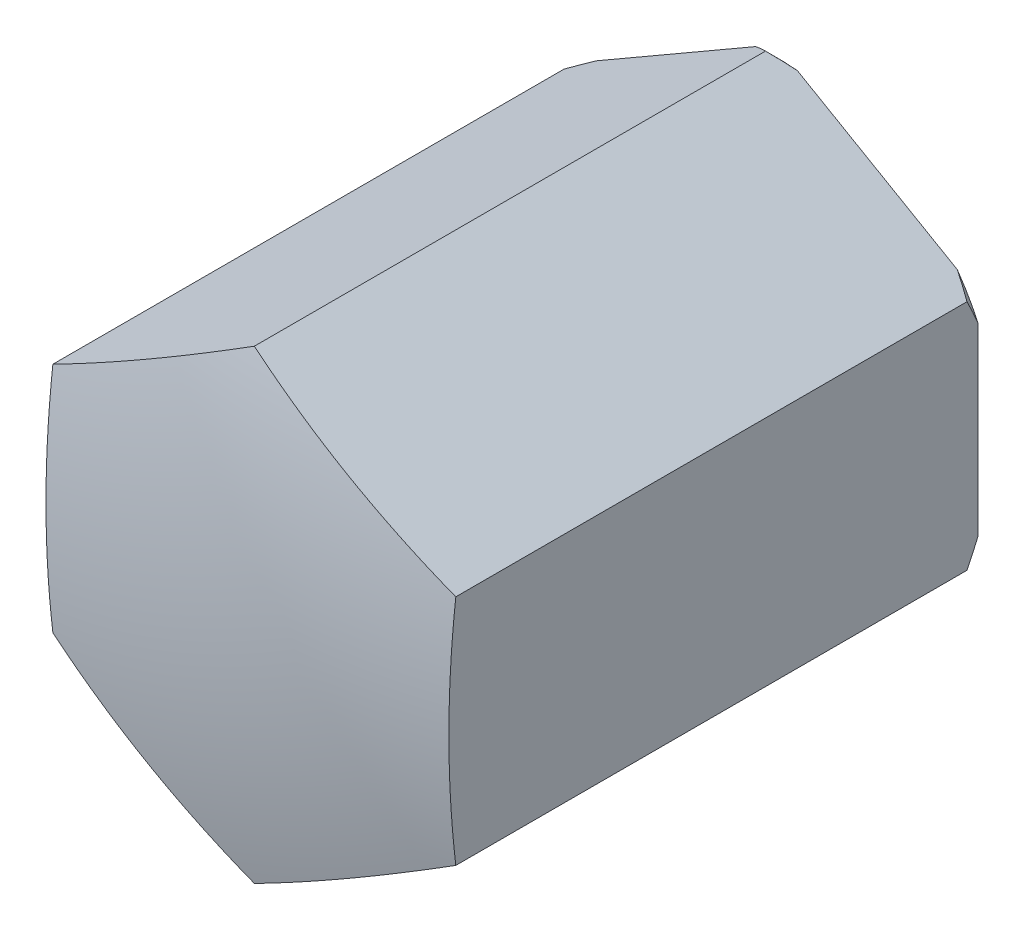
ISO-10303-21;
HEADER;
FILE_DESCRIPTION(('STEP AP214'),'2;1');
FILE_NAME('part.step','',(''),(''),'','','');
FILE_SCHEMA(('AUTOMOTIVE_DESIGN { 1 0 10303 214 1 1 1 1 }'));
ENDSEC;
DATA;
#1=APPLICATION_CONTEXT('core data for automotive mechanical design processes');
#2=APPLICATION_PROTOCOL_DEFINITION('international standard','automotive_design',2000,#1);
#3=PRODUCT_CONTEXT('',#1,'mechanical');
#4=PRODUCT('Part','Part','',(#3));
#5=PRODUCT_RELATED_PRODUCT_CATEGORY('part','',(#4));
#6=PRODUCT_DEFINITION_FORMATION('','',#4);
#7=PRODUCT_DEFINITION_CONTEXT('part definition',#1,'design');
#8=PRODUCT_DEFINITION('design','',#6,#7);
#9=PRODUCT_DEFINITION_SHAPE('','',#8);
#10=(LENGTH_UNIT() NAMED_UNIT(*) SI_UNIT(.MILLI.,.METRE.));
#11=(NAMED_UNIT(*) PLANE_ANGLE_UNIT() SI_UNIT($,.RADIAN.));
#12=(NAMED_UNIT(*) SI_UNIT($,.STERADIAN.) SOLID_ANGLE_UNIT());
#13=UNCERTAINTY_MEASURE_WITH_UNIT(LENGTH_MEASURE(1.E-05),#10,'distance_accuracy_value','');
#14=(GEOMETRIC_REPRESENTATION_CONTEXT(3) GLOBAL_UNCERTAINTY_ASSIGNED_CONTEXT((#13)) GLOBAL_UNIT_ASSIGNED_CONTEXT((#10,
#11,#12)) REPRESENTATION_CONTEXT('',''));
#15=CARTESIAN_POINT('',(0.,0.,0.));
#16=DIRECTION('',(0.,0.,1.));
#17=DIRECTION('',(1.,0.,0.));
#18=AXIS2_PLACEMENT_3D('',#15,#16,#17);
#19=CARTESIAN_POINT('',(0.,12.701705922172,31.));
#20=DIRECTION('',(0.500000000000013,-0.866025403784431,0.));
#21=DIRECTION('',(0.866025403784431,0.500000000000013,0.));
#22=AXIS2_PLACEMENT_3D('',#19,#20,#21);
#23=PLANE('',#22);
#24=CARTESIAN_POINT('',(-5.5000000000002,9.52627944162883,-25.));
#25=DIRECTION('',(0.500000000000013,-0.866025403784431,0.));
#26=DIRECTION('',(0.866025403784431,0.500000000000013,0.));
#27=AXIS2_PLACEMENT_3D('',#24,#25,#26);
#28=CIRCLE('',#27,53.8887743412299);
#29=CARTESIAN_POINT('',(0.,12.701705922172,28.5132382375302));
#30=VERTEX_POINT('',#29);
#31=CARTESIAN_POINT('',(-11.,6.3508529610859,28.5132382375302));
#32=VERTEX_POINT('',#31);
#33=EDGE_CURVE('E105',#30,#32,#28,.T.);
#34=ORIENTED_EDGE('',*,*,#33,.F.);
#35=DIRECTION('',(0.,0.,-1.));
#36=VECTOR('',#35,1.);
#37=CARTESIAN_POINT('',(0.,12.701705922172,31.));
#38=LINE('',#37,#36);
#39=CARTESIAN_POINT('',(0.,12.701705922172,0.601705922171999));
#40=VERTEX_POINT('',#39);
#41=EDGE_CURVE('E111',#30,#40,#38,.T.);
#42=ORIENTED_EDGE('',*,*,#41,.T.);
#43=CARTESIAN_POINT('',(0.000200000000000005,12.7018213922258,0.601821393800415));
#44=CARTESIAN_POINT('',(-0.0929349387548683,12.6480499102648,0.548049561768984));
#45=CARTESIAN_POINT('',(-0.186425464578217,12.594073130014,0.495094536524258));
#46=CARTESIAN_POINT('',(-0.374109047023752,12.4857139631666,0.390955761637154));
#47=CARTESIAN_POINT('',(-0.468301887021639,12.431331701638,0.339771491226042));
#48=CARTESIAN_POINT('',(-0.657438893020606,12.3221334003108,0.23927866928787));
#49=CARTESIAN_POINT('',(-0.752383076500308,12.2673173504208,0.189970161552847));
#50=CARTESIAN_POINT('',(-0.943063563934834,12.1572279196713,0.0933496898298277));
#51=CARTESIAN_POINT('',(-1.03880009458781,12.1019544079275,0.0460383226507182));
#52=CARTESIAN_POINT('',(-1.13492611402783,12.0464560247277,-0.00019999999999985));
#53=B_SPLINE_CURVE_WITH_KNOTS('',3,(#43,#44,#45,#46,#47,#48,#49,#50,#51,#52),.UNSPECIFIED.,.F.,
.F.,(4,2,2,2,4),(0.,0.360709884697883,0.721312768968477,1.08192406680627,1.44264237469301),.UNSPECIFIED.);
#54=CARTESIAN_POINT('',(-1.13451033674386,12.0466960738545,0.));
#55=VERTEX_POINT('',#54);
#56=EDGE_CURVE('E212',#40,#55,#53,.T.);
#57=ORIENTED_EDGE('',*,*,#56,.T.);
#58=DIRECTION('',(-0.866025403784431,-0.500000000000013,0.));
#59=VECTOR('',#58,1.);
#60=CARTESIAN_POINT('',(3.57499999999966,14.7657331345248,0.));
#61=LINE('',#60,#59);
#62=CARTESIAN_POINT('',(-9.86548966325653,7.00586280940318,0.));
#63=VERTEX_POINT('',#62);
#64=EDGE_CURVE('E23',#55,#63,#61,.T.);
#65=ORIENTED_EDGE('',*,*,#64,.T.);
#66=CARTESIAN_POINT('',(-9.86507388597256,7.00610285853,-0.000199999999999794));
#67=CARTESIAN_POINT('',(-9.96119990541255,6.95060447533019,0.046038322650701));
#68=CARTESIAN_POINT('',(-10.0569364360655,6.89533096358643,0.0933496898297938));
#69=CARTESIAN_POINT('',(-10.2476169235,6.78524153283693,0.189970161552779));
#70=CARTESIAN_POINT('',(-10.3425611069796,6.73042548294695,0.239278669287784));
#71=CARTESIAN_POINT('',(-10.5316981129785,6.62122718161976,0.339771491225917));
#72=CARTESIAN_POINT('',(-10.6258909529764,6.56684492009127,0.390955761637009));
#73=CARTESIAN_POINT('',(-10.8135745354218,6.4584857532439,0.495094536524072));
#74=CARTESIAN_POINT('',(-10.9070650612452,6.40450897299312,0.548049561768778));
#75=CARTESIAN_POINT('',(-11.0002,6.35073749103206,0.601821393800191));
#76=B_SPLINE_CURVE_WITH_KNOTS('',3,(#66,#67,#68,#69,#70,#71,#72,#73,#74,#75),.UNSPECIFIED.,.F.,
.F.,(4,2,2,2,4),(0.,0.360718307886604,0.721329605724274,1.08193248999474,1.4426423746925),.UNSPECIFIED.);
#77=CARTESIAN_POINT('',(-11.,6.3508529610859,0.601705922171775));
#78=VERTEX_POINT('',#77);
#79=EDGE_CURVE('E218',#63,#78,#76,.T.);
#80=ORIENTED_EDGE('',*,*,#79,.T.);
#81=DIRECTION('',(0.,0.,-1.));
#82=VECTOR('',#81,1.);
#83=CARTESIAN_POINT('',(-11.,6.3508529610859,31.));
#84=LINE('',#83,#82);
#85=EDGE_CURVE('E114',#32,#78,#84,.T.);
#86=ORIENTED_EDGE('',*,*,#85,.F.);
#87=EDGE_LOOP('',(#34,#42,#57,#65,#80,#86));
#88=FACE_BOUND('',#87,.T.);
#89=ADVANCED_FACE('F14',(#88),#23,.F.);
#90=CARTESIAN_POINT('',(-11.,6.3508529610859,31.));
#91=DIRECTION('',(1.,0.,0.));
#92=DIRECTION('',(0.,1.,0.));
#93=AXIS2_PLACEMENT_3D('',#90,#91,#92);
#94=PLANE('',#93);
#95=CARTESIAN_POINT('',(-11.,0.,-25.));
#96=DIRECTION('',(1.,0.,0.));
#97=DIRECTION('',(0.,0.,-1.));
#98=AXIS2_PLACEMENT_3D('',#95,#96,#97);
#99=CIRCLE('',#98,53.8887743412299);
#100=CARTESIAN_POINT('',(-11.,-6.3508529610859,28.5132382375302));
#101=VERTEX_POINT('',#100);
#102=EDGE_CURVE('E115',#32,#101,#99,.T.);
#103=ORIENTED_EDGE('',*,*,#102,.F.);
#104=ORIENTED_EDGE('',*,*,#85,.T.);
#105=CARTESIAN_POINT('',(-11.,16.0724477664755,7.37623108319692));
#106=CARTESIAN_POINT('',(-11.,15.8702057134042,7.2093371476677));
#107=CARTESIAN_POINT('',(-11.,15.6674737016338,7.04303709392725));
#108=CARTESIAN_POINT('',(-11.,15.2609313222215,6.71175492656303));
#109=CARTESIAN_POINT('',(-11.,15.0571209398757,6.54677283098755));
#110=CARTESIAN_POINT('',(-11.,14.4438351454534,6.05392702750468));
#111=CARTESIAN_POINT('',(-11.,14.0326017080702,5.72824373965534));
#112=CARTESIAN_POINT('',(-11.,13.1999564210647,5.08050106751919));
#113=CARTESIAN_POINT('',(-11.,12.7784823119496,4.75852150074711));
#114=CARTESIAN_POINT('',(-11.,11.9286566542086,4.12384110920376));
#115=CARTESIAN_POINT('',(-11.,11.5003057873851,3.81113937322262));
#116=CARTESIAN_POINT('',(-11.,10.5931500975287,3.16769731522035));
#117=CARTESIAN_POINT('',(-11.,10.1134868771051,2.83815635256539));
#118=CARTESIAN_POINT('',(-11.,9.38449294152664,2.35805816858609));
#119=CARTESIAN_POINT('',(-11.,9.13985858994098,2.20036220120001));
#120=CARTESIAN_POINT('',(-11.,8.64708986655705,1.89054685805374));
#121=CARTESIAN_POINT('',(-11.,8.39895566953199,1.73842720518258));
#122=CARTESIAN_POINT('',(-11.,7.89995903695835,1.441394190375));
#123=CARTESIAN_POINT('',(-11.,7.64911460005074,1.29645066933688));
#124=CARTESIAN_POINT('',(-11.,7.14316420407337,1.01414178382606));
#125=CARTESIAN_POINT('',(-11.,6.8880580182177,0.876776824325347));
#126=CARTESIAN_POINT('',(-11.,6.37340355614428,0.611087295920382));
#127=CARTESIAN_POINT('',(-11.,6.11385871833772,0.482756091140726));
#128=CARTESIAN_POINT('',(-11.,5.58983912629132,0.236644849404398));
#129=CARTESIAN_POINT('',(-11.,5.32536528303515,0.118862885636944));
#130=CARTESIAN_POINT('',(-11.,4.87055760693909,-0.0711489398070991));
#131=CARTESIAN_POINT('',(-11.,4.68153595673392,-0.146517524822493));
#132=CARTESIAN_POINT('',(-11.,4.30090682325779,-0.290396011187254));
#133=CARTESIAN_POINT('',(-11.,4.10929935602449,-0.35890595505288));
#134=CARTESIAN_POINT('',(-11.,3.53054922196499,-0.55302199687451));
#135=CARTESIAN_POINT('',(-11.,3.13947003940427,-0.667218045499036));
#136=CARTESIAN_POINT('',(-11.,2.3571577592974,-0.856520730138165));
#137=CARTESIAN_POINT('',(-11.,1.96613010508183,-0.932456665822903));
#138=CARTESIAN_POINT('',(-11.,1.3754168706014,-1.01606525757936));
#139=CARTESIAN_POINT('',(-11.,1.17780635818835,-1.03888598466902));
#140=CARTESIAN_POINT('',(-11.,0.781637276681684,-1.0740268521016));
#141=CARTESIAN_POINT('',(-11.,0.583078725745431,-1.0863471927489));
#142=CARTESIAN_POINT('',(-11.,0.196510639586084,-1.09984708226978));
#143=CARTESIAN_POINT('',(-11.,0.00852086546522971,-1.10160151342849));
#144=CARTESIAN_POINT('',(-11.,-0.367323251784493,-1.09547279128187));
#145=CARTESIAN_POINT('',(-11.,-0.555177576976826,-1.08758853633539));
#146=CARTESIAN_POINT('',(-11.,-0.930229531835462,-1.06232225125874));
#147=CARTESIAN_POINT('',(-11.,-1.11742721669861,-1.04494103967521));
#148=CARTESIAN_POINT('',(-11.,-1.49075054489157,-1.00099406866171));
#149=CARTESIAN_POINT('',(-11.,-1.67687603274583,-0.974427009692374));
#150=CARTESIAN_POINT('',(-11.,-2.24018324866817,-0.880381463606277));
#151=CARTESIAN_POINT('',(-11.,-2.61511811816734,-0.799063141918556));
#152=CARTESIAN_POINT('',(-11.,-3.35650285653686,-0.604878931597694));
#153=CARTESIAN_POINT('',(-11.,-3.72295280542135,-0.492013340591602));
#154=CARTESIAN_POINT('',(-11.,-4.4529629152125,-0.237887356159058));
#155=CARTESIAN_POINT('',(-11.,-4.81636046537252,-0.0961649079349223));
#156=CARTESIAN_POINT('',(-11.,-5.53386860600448,0.20927334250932));
#157=CARTESIAN_POINT('',(-11.,-5.88797506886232,0.372998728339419));
#158=CARTESIAN_POINT('',(-11.,-6.5885282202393,0.718563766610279));
#159=CARTESIAN_POINT('',(-11.,-6.93494780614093,0.900457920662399));
#160=CARTESIAN_POINT('',(-11.,-7.61987412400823,1.27837528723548));
#161=CARTESIAN_POINT('',(-11.,-7.95838202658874,1.47439639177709));
#162=CARTESIAN_POINT('',(-11.,-8.61194162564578,1.86785203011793));
#163=CARTESIAN_POINT('',(-11.,-8.92732558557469,2.06473756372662));
#164=CARTESIAN_POINT('',(-11.,-9.55267412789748,2.46695903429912));
#165=CARTESIAN_POINT('',(-11.,-9.86263830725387,2.67229559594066));
#166=CARTESIAN_POINT('',(-11.,-10.4753887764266,3.08826754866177));
#167=CARTESIAN_POINT('',(-11.,-10.7782124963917,3.29884800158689));
#168=CARTESIAN_POINT('',(-11.,-11.3796956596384,3.72570793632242));
#169=CARTESIAN_POINT('',(-11.,-11.6783562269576,3.94198583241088));
#170=CARTESIAN_POINT('',(-11.,-11.9752680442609,4.16059792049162));
#171=B_SPLINE_CURVE_WITH_KNOTS('',3,(#105,#106,#107,#108,#109,#110,#111,#112,#113,#114,#115,
#116,#117,#118,#119,#120,#121,#122,#123,#124,#125,#126,#127,#128,#129,#130,#131,#132,#133,#134,
#135,#136,#137,#138,#139,#140,#141,#142,#143,#144,#145,#146,#147,#148,#149,#150,#151,#152,#153,
#154,#155,#156,#157,#158,#159,#160,#161,#162,#163,#164,#165,#166,#167,#168,#169,#170),
.UNSPECIFIED.,.F.,.F.,(4,2,2,2,2,2,2,2,2,2,2,2,2,2,2,2,2,2,2,2,2,2,2,2,2,2,2,2,2,2,2,2,4),(0.,
0.7866358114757,1.57328237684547,3.14695168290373,4.73801099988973,6.32891353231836,
8.0743905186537,8.94750152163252,9.82056907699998,10.6895860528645,11.5586494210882,
12.4270675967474,13.2953268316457,13.9056838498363,14.5160370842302,15.7367149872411,
16.9296541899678,17.5261883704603,18.1227111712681,18.6864613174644,19.2502759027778,
19.8140419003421,20.3778876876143,21.5270730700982,22.6762476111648,23.845519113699,
25.0153015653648,26.1887049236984,27.3619335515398,28.4771587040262,29.5924664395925,
30.698929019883,31.8050868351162),.UNSPECIFIED.);
#172=CARTESIAN_POINT('',(-11.,5.04083326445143,0.));
#173=VERTEX_POINT('',#172);
#174=EDGE_CURVE('E211',#78,#173,#171,.T.);
#175=ORIENTED_EDGE('',*,*,#174,.T.);
#176=DIRECTION('',(0.,-1.,0.));
#177=VECTOR('',#176,1.);
#178=CARTESIAN_POINT('',(-11.,0.,0.));
#179=LINE('',#178,#177);
#180=CARTESIAN_POINT('',(-11.,-5.04083326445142,0.));
#181=VERTEX_POINT('',#180);
#182=EDGE_CURVE('E237',#173,#181,#179,.T.);
#183=ORIENTED_EDGE('',*,*,#182,.T.);
#184=CARTESIAN_POINT('',(-11.,-6.3508529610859,0.601705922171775));
#185=VERTEX_POINT('',#184);
#186=EDGE_CURVE('E204',#181,#185,#171,.T.);
#187=ORIENTED_EDGE('',*,*,#186,.T.);
#188=DIRECTION('',(0.,0.,-1.));
#189=VECTOR('',#188,1.);
#190=CARTESIAN_POINT('',(-11.,-6.3508529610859,31.));
#191=LINE('',#190,#189);
#192=EDGE_CURVE('E130',#101,#185,#191,.T.);
#193=ORIENTED_EDGE('',*,*,#192,.F.);
#194=EDGE_LOOP('',(#103,#104,#175,#183,#187,#193));
#195=FACE_BOUND('',#194,.T.);
#196=ADVANCED_FACE('F196',(#195),#94,.F.);
#197=CARTESIAN_POINT('',(-11.,-6.3508529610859,31.));
#198=DIRECTION('',(0.500000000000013,0.866025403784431,0.));
#199=DIRECTION('',(-0.866025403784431,0.500000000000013,0.));
#200=AXIS2_PLACEMENT_3D('',#197,#198,#199);
#201=PLANE('',#200);
#202=CARTESIAN_POINT('',(-5.5000000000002,-9.52627944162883,-25.));
#203=DIRECTION('',(0.500000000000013,0.866025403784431,0.));
#204=DIRECTION('',(-0.866025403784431,0.500000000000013,0.));
#205=AXIS2_PLACEMENT_3D('',#202,#203,#204);
#206=CIRCLE('',#205,53.8887743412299);
#207=CARTESIAN_POINT('',(0.,-12.701705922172,28.5132382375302));
#208=VERTEX_POINT('',#207);
#209=EDGE_CURVE('E284',#101,#208,#206,.T.);
#210=ORIENTED_EDGE('',*,*,#209,.F.);
#211=ORIENTED_EDGE('',*,*,#192,.T.);
#212=CARTESIAN_POINT('',(-11.0002,-6.35073749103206,0.601821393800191));
#213=CARTESIAN_POINT('',(-10.9070650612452,-6.40450897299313,0.548049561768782));
#214=CARTESIAN_POINT('',(-10.8135745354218,-6.4584857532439,0.495094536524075));
#215=CARTESIAN_POINT('',(-10.6258909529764,-6.56684492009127,0.390955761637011));
#216=CARTESIAN_POINT('',(-10.5316981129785,-6.62122718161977,0.339771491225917));
#217=CARTESIAN_POINT('',(-10.3425611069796,-6.73042548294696,0.239278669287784));
#218=CARTESIAN_POINT('',(-10.2476169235,-6.78524153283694,0.189970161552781));
#219=CARTESIAN_POINT('',(-10.0569364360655,-6.89533096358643,0.093349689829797));
#220=CARTESIAN_POINT('',(-9.96119990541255,-6.95060447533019,0.0460383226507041));
#221=CARTESIAN_POINT('',(-9.86507388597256,-7.00610285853,-0.0002000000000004));
#222=B_SPLINE_CURVE_WITH_KNOTS('',3,(#212,#213,#214,#215,#216,#217,#218,#219,#220,#221),
.UNSPECIFIED.,.F.,.F.,(4,2,2,2,4),(0.,0.360709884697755,0.721312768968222,1.08192406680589,
1.4426423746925),.UNSPECIFIED.);
#223=CARTESIAN_POINT('',(-9.86548966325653,-7.00586280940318,0.));
#224=VERTEX_POINT('',#223);
#225=EDGE_CURVE('E180',#185,#224,#222,.T.);
#226=ORIENTED_EDGE('',*,*,#225,.T.);
#227=DIRECTION('',(0.866025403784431,-0.500000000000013,0.));
#228=VECTOR('',#227,1.);
#229=CARTESIAN_POINT('',(3.57499999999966,-14.7657331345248,0.));
#230=LINE('',#229,#228);
#231=CARTESIAN_POINT('',(-1.13451033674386,-12.0466960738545,0.));
#232=VERTEX_POINT('',#231);
#233=EDGE_CURVE('E235',#224,#232,#230,.T.);
#234=ORIENTED_EDGE('',*,*,#233,.T.);
#235=CARTESIAN_POINT('',(-1.13492611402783,-12.0464560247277,-0.0002));
#236=CARTESIAN_POINT('',(-1.03880009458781,-12.1019544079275,0.0460383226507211));
#237=CARTESIAN_POINT('',(-0.943063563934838,-12.1572279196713,0.0933496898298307));
#238=CARTESIAN_POINT('',(-0.752383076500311,-12.2673173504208,0.189970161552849));
#239=CARTESIAN_POINT('',(-0.657438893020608,-12.3221334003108,0.23927866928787));
#240=CARTESIAN_POINT('',(-0.46830188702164,-12.431331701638,0.339771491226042));
#241=CARTESIAN_POINT('',(-0.374109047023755,-12.4857139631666,0.390955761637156));
#242=CARTESIAN_POINT('',(-0.186425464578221,-12.594073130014,0.495094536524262));
#243=CARTESIAN_POINT('',(-0.0929349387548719,-12.6480499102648,0.548049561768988));
#244=CARTESIAN_POINT('',(0.000199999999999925,-12.7018213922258,0.601821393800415));
#245=B_SPLINE_CURVE_WITH_KNOTS('',3,(#235,#236,#237,#238,#239,#240,#241,#242,#243,#244),
.UNSPECIFIED.,.F.,.F.,(4,2,2,2,4),(0.,0.360718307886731,0.721329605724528,1.08193248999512,
1.44264237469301),.UNSPECIFIED.);
#246=CARTESIAN_POINT('',(0.,-12.701705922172,0.601705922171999));
#247=VERTEX_POINT('',#246);
#248=EDGE_CURVE('E186',#232,#247,#245,.T.);
#249=ORIENTED_EDGE('',*,*,#248,.T.);
#250=DIRECTION('',(0.,0.,-1.));
#251=VECTOR('',#250,1.);
#252=CARTESIAN_POINT('',(0.,-12.701705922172,31.));
#253=LINE('',#252,#251);
#254=EDGE_CURVE('E128',#208,#247,#253,.T.);
#255=ORIENTED_EDGE('',*,*,#254,.F.);
#256=EDGE_LOOP('',(#210,#211,#226,#234,#249,#255));
#257=FACE_BOUND('',#256,.T.);
#258=ADVANCED_FACE('F192',(#257),#201,.F.);
#259=CARTESIAN_POINT('',(0.,-12.701705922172,31.));
#260=DIRECTION('',(-0.500000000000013,0.866025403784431,0.));
#261=DIRECTION('',(-0.866025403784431,-0.500000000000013,0.));
#262=AXIS2_PLACEMENT_3D('',#259,#260,#261);
#263=PLANE('',#262);
#264=CARTESIAN_POINT('',(5.5000000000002,-9.52627944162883,-25.));
#265=DIRECTION('',(-0.500000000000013,0.866025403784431,0.));
#266=DIRECTION('',(-0.866025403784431,-0.500000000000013,0.));
#267=AXIS2_PLACEMENT_3D('',#264,#265,#266);
#268=CIRCLE('',#267,53.8887743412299);
#269=CARTESIAN_POINT('',(11.,-6.3508529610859,28.5132382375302));
#270=VERTEX_POINT('',#269);
#271=EDGE_CURVE('E285',#208,#270,#268,.T.);
#272=ORIENTED_EDGE('',*,*,#271,.F.);
#273=ORIENTED_EDGE('',*,*,#254,.T.);
#274=CARTESIAN_POINT('',(-0.000200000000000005,-12.7018213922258,0.601821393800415));
#275=CARTESIAN_POINT('',(0.0929349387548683,-12.6480499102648,0.548049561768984));
#276=CARTESIAN_POINT('',(0.186425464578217,-12.594073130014,0.495094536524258));
#277=CARTESIAN_POINT('',(0.374109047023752,-12.4857139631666,0.390955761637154));
#278=CARTESIAN_POINT('',(0.468301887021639,-12.431331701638,0.339771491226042));
#279=CARTESIAN_POINT('',(0.657438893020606,-12.3221334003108,0.23927866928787));
#280=CARTESIAN_POINT('',(0.752383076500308,-12.2673173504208,0.189970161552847));
#281=CARTESIAN_POINT('',(0.943063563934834,-12.1572279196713,0.0933496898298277));
#282=CARTESIAN_POINT('',(1.03880009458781,-12.1019544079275,0.0460383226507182));
#283=CARTESIAN_POINT('',(1.13492611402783,-12.0464560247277,-0.00019999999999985));
#284=B_SPLINE_CURVE_WITH_KNOTS('',3,(#274,#275,#276,#277,#278,#279,#280,#281,#282,#283),
.UNSPECIFIED.,.F.,.F.,(4,2,2,2,4),(0.,0.360709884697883,0.721312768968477,1.08192406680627,
1.44264237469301),.UNSPECIFIED.);
#285=CARTESIAN_POINT('',(1.13451033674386,-12.0466960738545,0.));
#286=VERTEX_POINT('',#285);
#287=EDGE_CURVE('E167',#247,#286,#284,.T.);
#288=ORIENTED_EDGE('',*,*,#287,.T.);
#289=DIRECTION('',(0.866025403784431,0.500000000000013,0.));
#290=VECTOR('',#289,1.);
#291=CARTESIAN_POINT('',(14.575,-4.28682574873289,0.));
#292=LINE('',#291,#290);
#293=CARTESIAN_POINT('',(9.86548966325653,-7.00586280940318,0.));
#294=VERTEX_POINT('',#293);
#295=EDGE_CURVE('E233',#286,#294,#292,.T.);
#296=ORIENTED_EDGE('',*,*,#295,.T.);
#297=CARTESIAN_POINT('',(9.86507388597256,-7.00610285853,-0.000199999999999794));
#298=CARTESIAN_POINT('',(9.96119990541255,-6.95060447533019,0.046038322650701));
#299=CARTESIAN_POINT('',(10.0569364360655,-6.89533096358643,0.0933496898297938));
#300=CARTESIAN_POINT('',(10.2476169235,-6.78524153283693,0.189970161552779));
#301=CARTESIAN_POINT('',(10.3425611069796,-6.73042548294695,0.239278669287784));
#302=CARTESIAN_POINT('',(10.5316981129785,-6.62122718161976,0.339771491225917));
#303=CARTESIAN_POINT('',(10.6258909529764,-6.56684492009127,0.390955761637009));
#304=CARTESIAN_POINT('',(10.8135745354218,-6.4584857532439,0.495094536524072));
#305=CARTESIAN_POINT('',(10.9070650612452,-6.40450897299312,0.548049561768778));
#306=CARTESIAN_POINT('',(11.0002,-6.35073749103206,0.601821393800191));
#307=B_SPLINE_CURVE_WITH_KNOTS('',3,(#297,#298,#299,#300,#301,#302,#303,#304,#305,#306),
.UNSPECIFIED.,.F.,.F.,(4,2,2,2,4),(0.,0.360718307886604,0.721329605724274,1.08193248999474,
1.4426423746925),.UNSPECIFIED.);
#308=CARTESIAN_POINT('',(11.,-6.3508529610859,0.601705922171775));
#309=VERTEX_POINT('',#308);
#310=EDGE_CURVE('E173',#294,#309,#307,.T.);
#311=ORIENTED_EDGE('',*,*,#310,.T.);
#312=DIRECTION('',(0.,0.,-1.));
#313=VECTOR('',#312,1.);
#314=CARTESIAN_POINT('',(11.,-6.3508529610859,31.));
#315=LINE('',#314,#313);
#316=EDGE_CURVE('E123',#270,#309,#315,.T.);
#317=ORIENTED_EDGE('',*,*,#316,.F.);
#318=EDGE_LOOP('',(#272,#273,#288,#296,#311,#317));
#319=FACE_BOUND('',#318,.T.);
#320=ADVANCED_FACE('F155',(#319),#263,.F.);
#321=CARTESIAN_POINT('',(11.,-6.3508529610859,31.));
#322=DIRECTION('',(-1.,0.,0.));
#323=DIRECTION('',(0.,-1.,0.));
#324=AXIS2_PLACEMENT_3D('',#321,#322,#323);
#325=PLANE('',#324);
#326=CARTESIAN_POINT('',(11.,0.,-25.));
#327=DIRECTION('',(-1.,0.,0.));
#328=DIRECTION('',(0.,0.,1.));
#329=AXIS2_PLACEMENT_3D('',#326,#327,#328);
#330=CIRCLE('',#329,53.8887743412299);
#331=CARTESIAN_POINT('',(11.,6.3508529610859,28.5132382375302));
#332=VERTEX_POINT('',#331);
#333=EDGE_CURVE('E29',#270,#332,#330,.T.);
#334=ORIENTED_EDGE('',*,*,#333,.F.);
#335=ORIENTED_EDGE('',*,*,#316,.T.);
#336=CARTESIAN_POINT('',(11.,16.0724477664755,7.37623108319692));
#337=CARTESIAN_POINT('',(11.,15.8702057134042,7.2093371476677));
#338=CARTESIAN_POINT('',(11.,15.6674737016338,7.04303709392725));
#339=CARTESIAN_POINT('',(11.,15.2609313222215,6.71175492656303));
#340=CARTESIAN_POINT('',(11.,15.0571209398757,6.54677283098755));
#341=CARTESIAN_POINT('',(11.,14.4438351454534,6.05392702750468));
#342=CARTESIAN_POINT('',(11.,14.0326017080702,5.72824373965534));
#343=CARTESIAN_POINT('',(11.,13.1999564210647,5.08050106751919));
#344=CARTESIAN_POINT('',(11.,12.7784823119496,4.75852150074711));
#345=CARTESIAN_POINT('',(11.,11.9286566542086,4.12384110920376));
#346=CARTESIAN_POINT('',(11.,11.5003057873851,3.81113937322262));
#347=CARTESIAN_POINT('',(11.,10.5931500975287,3.16769731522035));
#348=CARTESIAN_POINT('',(11.,10.1134868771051,2.83815635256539));
#349=CARTESIAN_POINT('',(11.,9.38449294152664,2.35805816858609));
#350=CARTESIAN_POINT('',(11.,9.13985858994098,2.20036220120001));
#351=CARTESIAN_POINT('',(11.,8.64708986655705,1.89054685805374));
#352=CARTESIAN_POINT('',(11.,8.39895566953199,1.73842720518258));
#353=CARTESIAN_POINT('',(11.,7.89995903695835,1.441394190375));
#354=CARTESIAN_POINT('',(11.,7.64911460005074,1.29645066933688));
#355=CARTESIAN_POINT('',(11.,7.14316420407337,1.01414178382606));
#356=CARTESIAN_POINT('',(11.,6.8880580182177,0.876776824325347));
#357=CARTESIAN_POINT('',(11.,6.37340355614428,0.611087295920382));
#358=CARTESIAN_POINT('',(11.,6.11385871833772,0.482756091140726));
#359=CARTESIAN_POINT('',(11.,5.58983912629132,0.236644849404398));
#360=CARTESIAN_POINT('',(11.,5.32536528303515,0.118862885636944));
#361=CARTESIAN_POINT('',(11.,4.87055760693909,-0.0711489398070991));
#362=CARTESIAN_POINT('',(11.,4.68153595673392,-0.146517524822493));
#363=CARTESIAN_POINT('',(11.,4.30090682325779,-0.290396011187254));
#364=CARTESIAN_POINT('',(11.,4.10929935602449,-0.35890595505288));
#365=CARTESIAN_POINT('',(11.,3.53054922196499,-0.55302199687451));
#366=CARTESIAN_POINT('',(11.,3.13947003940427,-0.667218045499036));
#367=CARTESIAN_POINT('',(11.,2.3571577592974,-0.856520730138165));
#368=CARTESIAN_POINT('',(11.,1.96613010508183,-0.932456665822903));
#369=CARTESIAN_POINT('',(11.,1.3754168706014,-1.01606525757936));
#370=CARTESIAN_POINT('',(11.,1.17780635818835,-1.03888598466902));
#371=CARTESIAN_POINT('',(11.,0.781637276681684,-1.0740268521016));
#372=CARTESIAN_POINT('',(11.,0.583078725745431,-1.0863471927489));
#373=CARTESIAN_POINT('',(11.,0.196510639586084,-1.09984708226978));
#374=CARTESIAN_POINT('',(11.,0.00852086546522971,-1.10160151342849));
#375=CARTESIAN_POINT('',(11.,-0.367323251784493,-1.09547279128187));
#376=CARTESIAN_POINT('',(11.,-0.555177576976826,-1.08758853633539));
#377=CARTESIAN_POINT('',(11.,-0.930229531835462,-1.06232225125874));
#378=CARTESIAN_POINT('',(11.,-1.11742721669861,-1.04494103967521));
#379=CARTESIAN_POINT('',(11.,-1.49075054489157,-1.00099406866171));
#380=CARTESIAN_POINT('',(11.,-1.67687603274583,-0.974427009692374));
#381=CARTESIAN_POINT('',(11.,-2.24018324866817,-0.880381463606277));
#382=CARTESIAN_POINT('',(11.,-2.61511811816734,-0.799063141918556));
#383=CARTESIAN_POINT('',(11.,-3.35650285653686,-0.604878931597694));
#384=CARTESIAN_POINT('',(11.,-3.72295280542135,-0.492013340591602));
#385=CARTESIAN_POINT('',(11.,-4.4529629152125,-0.237887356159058));
#386=CARTESIAN_POINT('',(11.,-4.81636046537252,-0.0961649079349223));
#387=CARTESIAN_POINT('',(11.,-5.53386860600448,0.20927334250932));
#388=CARTESIAN_POINT('',(11.,-5.88797506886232,0.372998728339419));
#389=CARTESIAN_POINT('',(11.,-6.5885282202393,0.718563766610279));
#390=CARTESIAN_POINT('',(11.,-6.93494780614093,0.900457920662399));
#391=CARTESIAN_POINT('',(11.,-7.61987412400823,1.27837528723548));
#392=CARTESIAN_POINT('',(11.,-7.95838202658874,1.47439639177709));
#393=CARTESIAN_POINT('',(11.,-8.61194162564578,1.86785203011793));
#394=CARTESIAN_POINT('',(11.,-8.92732558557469,2.06473756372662));
#395=CARTESIAN_POINT('',(11.,-9.55267412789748,2.46695903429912));
#396=CARTESIAN_POINT('',(11.,-9.86263830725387,2.67229559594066));
#397=CARTESIAN_POINT('',(11.,-10.4753887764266,3.08826754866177));
#398=CARTESIAN_POINT('',(11.,-10.7782124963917,3.29884800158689));
#399=CARTESIAN_POINT('',(11.,-11.3796956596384,3.72570793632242));
#400=CARTESIAN_POINT('',(11.,-11.6783562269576,3.94198583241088));
#401=CARTESIAN_POINT('',(11.,-11.9752680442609,4.16059792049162));
#402=B_SPLINE_CURVE_WITH_KNOTS('',3,(#336,#337,#338,#339,#340,#341,#342,#343,#344,#345,#346,
#347,#348,#349,#350,#351,#352,#353,#354,#355,#356,#357,#358,#359,#360,#361,#362,#363,#364,#365,
#366,#367,#368,#369,#370,#371,#372,#373,#374,#375,#376,#377,#378,#379,#380,#381,#382,#383,#384,
#385,#386,#387,#388,#389,#390,#391,#392,#393,#394,#395,#396,#397,#398,#399,#400,#401),
.UNSPECIFIED.,.F.,.F.,(4,2,2,2,2,2,2,2,2,2,2,2,2,2,2,2,2,2,2,2,2,2,2,2,2,2,2,2,2,2,2,2,4),(0.,
0.7866358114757,1.57328237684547,3.14695168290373,4.73801099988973,6.32891353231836,
8.0743905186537,8.94750152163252,9.82056907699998,10.6895860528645,11.5586494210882,
12.4270675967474,13.2953268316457,13.9056838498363,14.5160370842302,15.7367149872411,
16.9296541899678,17.5261883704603,18.1227111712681,18.6864613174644,19.2502759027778,
19.8140419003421,20.3778876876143,21.5270730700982,22.6762476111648,23.845519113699,
25.0153015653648,26.1887049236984,27.3619335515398,28.4771587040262,29.5924664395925,
30.698929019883,31.8050868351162),.UNSPECIFIED.);
#403=CARTESIAN_POINT('',(11.,-5.04083326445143,0.));
#404=VERTEX_POINT('',#403);
#405=EDGE_CURVE('E166',#309,#404,#402,.F.);
#406=ORIENTED_EDGE('',*,*,#405,.T.);
#407=DIRECTION('',(0.,1.,0.));
#408=VECTOR('',#407,1.);
#409=CARTESIAN_POINT('',(11.,0.,0.));
#410=LINE('',#409,#408);
#411=CARTESIAN_POINT('',(11.,5.04083326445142,0.));
#412=VERTEX_POINT('',#411);
#413=EDGE_CURVE('E231',#404,#412,#410,.T.);
#414=ORIENTED_EDGE('',*,*,#413,.T.);
#415=CARTESIAN_POINT('',(11.,6.3508529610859,0.601705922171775));
#416=VERTEX_POINT('',#415);
#417=EDGE_CURVE('E159',#412,#416,#402,.F.);
#418=ORIENTED_EDGE('',*,*,#417,.T.);
#419=DIRECTION('',(0.,0.,-1.));
#420=VECTOR('',#419,1.);
#421=CARTESIAN_POINT('',(11.,6.3508529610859,31.));
#422=LINE('',#421,#420);
#423=EDGE_CURVE('E121',#332,#416,#422,.T.);
#424=ORIENTED_EDGE('',*,*,#423,.F.);
#425=EDGE_LOOP('',(#334,#335,#406,#414,#418,#424));
#426=FACE_BOUND('',#425,.T.);
#427=ADVANCED_FACE('F149',(#426),#325,.F.);
#428=CARTESIAN_POINT('',(11.,6.3508529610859,31.));
#429=DIRECTION('',(-0.500000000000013,-0.866025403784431,0.));
#430=DIRECTION('',(0.866025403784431,-0.500000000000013,0.));
#431=AXIS2_PLACEMENT_3D('',#428,#429,#430);
#432=PLANE('',#431);
#433=CARTESIAN_POINT('',(5.5000000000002,9.52627944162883,-25.));
#434=DIRECTION('',(-0.500000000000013,-0.866025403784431,0.));
#435=DIRECTION('',(0.866025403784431,-0.500000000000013,0.));
#436=AXIS2_PLACEMENT_3D('',#433,#434,#435);
#437=CIRCLE('',#436,53.8887743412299);
#438=EDGE_CURVE('E9',#332,#30,#437,.T.);
#439=ORIENTED_EDGE('',*,*,#438,.F.);
#440=ORIENTED_EDGE('',*,*,#423,.T.);
#441=CARTESIAN_POINT('',(11.0002,6.35073749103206,0.601821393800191));
#442=CARTESIAN_POINT('',(10.9070650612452,6.40450897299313,0.548049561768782));
#443=CARTESIAN_POINT('',(10.8135745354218,6.4584857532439,0.495094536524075));
#444=CARTESIAN_POINT('',(10.6258909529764,6.56684492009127,0.390955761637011));
#445=CARTESIAN_POINT('',(10.5316981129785,6.62122718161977,0.339771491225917));
#446=CARTESIAN_POINT('',(10.3425611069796,6.73042548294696,0.239278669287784));
#447=CARTESIAN_POINT('',(10.2476169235,6.78524153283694,0.189970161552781));
#448=CARTESIAN_POINT('',(10.0569364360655,6.89533096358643,0.093349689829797));
#449=CARTESIAN_POINT('',(9.96119990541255,6.95060447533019,0.0460383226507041));
#450=CARTESIAN_POINT('',(9.86507388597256,7.00610285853,-0.0002000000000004));
#451=B_SPLINE_CURVE_WITH_KNOTS('',3,(#441,#442,#443,#444,#445,#446,#447,#448,#449,#450),
.UNSPECIFIED.,.F.,.F.,(4,2,2,2,4),(0.,0.360709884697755,0.721312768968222,1.08192406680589,
1.4426423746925),.UNSPECIFIED.);
#452=CARTESIAN_POINT('',(9.86548966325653,7.00586280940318,0.));
#453=VERTEX_POINT('',#452);
#454=EDGE_CURVE('E37',#416,#453,#451,.T.);
#455=ORIENTED_EDGE('',*,*,#454,.T.);
#456=DIRECTION('',(-0.866025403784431,0.500000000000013,0.));
#457=VECTOR('',#456,1.);
#458=CARTESIAN_POINT('',(14.575,4.28682574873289,0.));
#459=LINE('',#458,#457);
#460=CARTESIAN_POINT('',(1.13451033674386,12.0466960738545,0.));
#461=VERTEX_POINT('',#460);
#462=EDGE_CURVE('E229',#453,#461,#459,.T.);
#463=ORIENTED_EDGE('',*,*,#462,.T.);
#464=CARTESIAN_POINT('',(1.13492611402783,12.0464560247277,-0.0002));
#465=CARTESIAN_POINT('',(1.03880009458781,12.1019544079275,0.0460383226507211));
#466=CARTESIAN_POINT('',(0.943063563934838,12.1572279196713,0.0933496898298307));
#467=CARTESIAN_POINT('',(0.752383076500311,12.2673173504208,0.189970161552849));
#468=CARTESIAN_POINT('',(0.657438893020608,12.3221334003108,0.23927866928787));
#469=CARTESIAN_POINT('',(0.46830188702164,12.431331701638,0.339771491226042));
#470=CARTESIAN_POINT('',(0.374109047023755,12.4857139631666,0.390955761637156));
#471=CARTESIAN_POINT('',(0.186425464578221,12.594073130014,0.495094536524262));
#472=CARTESIAN_POINT('',(0.0929349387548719,12.6480499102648,0.548049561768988));
#473=CARTESIAN_POINT('',(-0.000199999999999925,12.7018213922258,0.601821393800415));
#474=B_SPLINE_CURVE_WITH_KNOTS('',3,(#464,#465,#466,#467,#468,#469,#470,#471,#472,#473),
.UNSPECIFIED.,.F.,.F.,(4,2,2,2,4),(0.,0.360718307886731,0.721329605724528,1.08193248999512,
1.44264237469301),.UNSPECIFIED.);
#475=EDGE_CURVE('E119',#461,#40,#474,.T.);
#476=ORIENTED_EDGE('',*,*,#475,.T.);
#477=ORIENTED_EDGE('',*,*,#41,.F.);
#478=EDGE_LOOP('',(#439,#440,#455,#463,#476,#477));
#479=FACE_BOUND('',#478,.T.);
#480=ADVANCED_FACE('F117',(#479),#432,.F.);
#481=CARTESIAN_POINT('',(0.,0.,0.));
#482=DIRECTION('',(0.,0.,1.));
#483=DIRECTION('',(0.,-1.,0.));
#484=AXIS2_PLACEMENT_3D('',#481,#482,#483);
#485=CONICAL_SURFACE('',#484,12.1,0.785398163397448);
#486=ORIENTED_EDGE('',*,*,#79,.F.);
#487=CARTESIAN_POINT('',(0.,0.,0.));
#488=DIRECTION('',(0.,0.,-1.));
#489=DIRECTION('',(0.,1.,0.));
#490=AXIS2_PLACEMENT_3D('',#487,#488,#489);
#491=CIRCLE('',#490,12.1);
#492=EDGE_CURVE('E227',#173,#63,#491,.T.);
#493=ORIENTED_EDGE('',*,*,#492,.F.);
#494=ORIENTED_EDGE('',*,*,#174,.F.);
#495=EDGE_LOOP('',(#486,#493,#494));
#496=FACE_BOUND('',#495,.T.);
#497=ADVANCED_FACE('F148',(#496),#485,.T.);
#498=ORIENTED_EDGE('',*,*,#186,.F.);
#499=EDGE_CURVE('E250',#224,#181,#491,.T.);
#500=ORIENTED_EDGE('',*,*,#499,.F.);
#501=ORIENTED_EDGE('',*,*,#225,.F.);
#502=EDGE_LOOP('',(#498,#500,#501));
#503=FACE_BOUND('',#502,.T.);
#504=ADVANCED_FACE('F282',(#503),#485,.T.);
#505=ORIENTED_EDGE('',*,*,#248,.F.);
#506=EDGE_CURVE('E251',#286,#232,#491,.T.);
#507=ORIENTED_EDGE('',*,*,#506,.F.);
#508=ORIENTED_EDGE('',*,*,#287,.F.);
#509=EDGE_LOOP('',(#505,#507,#508));
#510=FACE_BOUND('',#509,.T.);
#511=ADVANCED_FACE('F275',(#510),#485,.T.);
#512=ORIENTED_EDGE('',*,*,#310,.F.);
#513=EDGE_CURVE('E255',#404,#294,#491,.T.);
#514=ORIENTED_EDGE('',*,*,#513,.F.);
#515=ORIENTED_EDGE('',*,*,#405,.F.);
#516=EDGE_LOOP('',(#512,#514,#515));
#517=FACE_BOUND('',#516,.T.);
#518=ADVANCED_FACE('F269',(#517),#485,.T.);
#519=ORIENTED_EDGE('',*,*,#56,.F.);
#520=ORIENTED_EDGE('',*,*,#475,.F.);
#521=EDGE_CURVE('E224',#55,#461,#491,.T.);
#522=ORIENTED_EDGE('',*,*,#521,.F.);
#523=EDGE_LOOP('',(#519,#520,#522));
#524=FACE_BOUND('',#523,.T.);
#525=ADVANCED_FACE('F310',(#524),#485,.T.);
#526=ORIENTED_EDGE('',*,*,#417,.F.);
#527=EDGE_CURVE('E228',#453,#412,#491,.T.);
#528=ORIENTED_EDGE('',*,*,#527,.F.);
#529=ORIENTED_EDGE('',*,*,#454,.F.);
#530=EDGE_LOOP('',(#526,#528,#529));
#531=FACE_BOUND('',#530,.T.);
#532=ADVANCED_FACE('F16',(#531),#485,.T.);
#533=CARTESIAN_POINT('',(12.1,0.,0.));
#534=DIRECTION('',(0.,0.,-1.));
#535=DIRECTION('',(0.,1.,0.));
#536=AXIS2_PLACEMENT_3D('',#533,#534,#535);
#537=PLANE('',#536);
#538=ORIENTED_EDGE('',*,*,#64,.F.);
#539=ORIENTED_EDGE('',*,*,#521,.T.);
#540=ORIENTED_EDGE('',*,*,#462,.F.);
#541=ORIENTED_EDGE('',*,*,#527,.T.);
#542=ORIENTED_EDGE('',*,*,#413,.F.);
#543=ORIENTED_EDGE('',*,*,#513,.T.);
#544=ORIENTED_EDGE('',*,*,#295,.F.);
#545=ORIENTED_EDGE('',*,*,#506,.T.);
#546=ORIENTED_EDGE('',*,*,#233,.F.);
#547=ORIENTED_EDGE('',*,*,#499,.T.);
#548=ORIENTED_EDGE('',*,*,#182,.F.);
#549=ORIENTED_EDGE('',*,*,#492,.T.);
#550=EDGE_LOOP('',(#538,#539,#540,#541,#542,#543,#544,#545,#546,#547,#548,#549));
#551=FACE_BOUND('',#550,.T.);
#552=CARTESIAN_POINT('',(0.,0.,0.));
#553=DIRECTION('',(0.,0.,-1.));
#554=DIRECTION('',(-1.,0.,0.));
#555=AXIS2_PLACEMENT_3D('',#552,#553,#554);
#556=CIRCLE('',#555,6.);
#557=CARTESIAN_POINT('',(-6.,0.,0.));
#558=VERTEX_POINT('',#557);
#559=EDGE_CURVE('E291',#558,#558,#556,.T.);
#560=ORIENTED_EDGE('',*,*,#559,.F.);
#561=EDGE_LOOP('',(#560));
#562=FACE_BOUND('',#561,.T.);
#563=ADVANCED_FACE('F247',(#551,#562),#537,.T.);
#564=CARTESIAN_POINT('',(0.,0.,-25.));
#565=DIRECTION('',(0.,0.,1.));
#566=DIRECTION('',(0.,-1.,0.));
#567=AXIS2_PLACEMENT_3D('',#564,#565,#566);
#568=SPHERICAL_SURFACE('',#567,55.);
#569=CARTESIAN_POINT('',(0.,0.,30.));
#570=VERTEX_POINT('',#569);
#571=VERTEX_LOOP('',#570);
#572=FACE_BOUND('',#571,.T.);
#573=ORIENTED_EDGE('',*,*,#33,.T.);
#574=ORIENTED_EDGE('',*,*,#102,.T.);
#575=ORIENTED_EDGE('',*,*,#209,.T.);
#576=ORIENTED_EDGE('',*,*,#271,.T.);
#577=ORIENTED_EDGE('',*,*,#333,.T.);
#578=ORIENTED_EDGE('',*,*,#438,.T.);
#579=EDGE_LOOP('',(#573,#574,#575,#576,#577,#578));
#580=FACE_BOUND('',#579,.T.);
#581=ADVANCED_FACE('F104',(#572,#580),#568,.T.);
#582=CARTESIAN_POINT('',(0.,0.,20.));
#583=DIRECTION('',(0.,0.,-1.));
#584=DIRECTION('',(-1.,0.,0.));
#585=AXIS2_PLACEMENT_3D('',#582,#583,#584);
#586=CYLINDRICAL_SURFACE('',#585,6.);
#587=CARTESIAN_POINT('',(0.,0.,20.));
#588=DIRECTION('',(0.,0.,-1.));
#589=DIRECTION('',(-1.,0.,0.));
#590=AXIS2_PLACEMENT_3D('',#587,#588,#589);
#591=CIRCLE('',#590,6.);
#592=CARTESIAN_POINT('',(-6.,0.,20.));
#593=VERTEX_POINT('',#592);
#594=EDGE_CURVE('E290',#593,#593,#591,.T.);
#595=ORIENTED_EDGE('',*,*,#594,.F.);
#596=EDGE_LOOP('',(#595));
#597=FACE_BOUND('',#596,.T.);
#598=ORIENTED_EDGE('',*,*,#559,.T.);
#599=EDGE_LOOP('',(#598));
#600=FACE_BOUND('',#599,.T.);
#601=ADVANCED_FACE('F299',(#597,#600),#586,.F.);
#602=CARTESIAN_POINT('',(0.,0.,20.));
#603=DIRECTION('',(0.,0.,-1.));
#604=DIRECTION('',(-1.,0.,0.));
#605=AXIS2_PLACEMENT_3D('',#602,#603,#604);
#606=PLANE('',#605);
#607=ORIENTED_EDGE('',*,*,#594,.T.);
#608=EDGE_LOOP('',(#607));
#609=FACE_BOUND('',#608,.T.);
#610=ADVANCED_FACE('F297',(#609),#606,.T.);
#611=CLOSED_SHELL('',(#89,#196,#258,#320,#427,#480,#497,#504,#511,#518,#525,#532,#563,#581,#601,#610));
#612=MANIFOLD_SOLID_BREP('B1',#611);
#613=ADVANCED_BREP_SHAPE_REPRESENTATION('',(#18,#612),#14);
#614=SHAPE_DEFINITION_REPRESENTATION(#9,#613);
ENDSEC;
END-ISO-10303-21;
